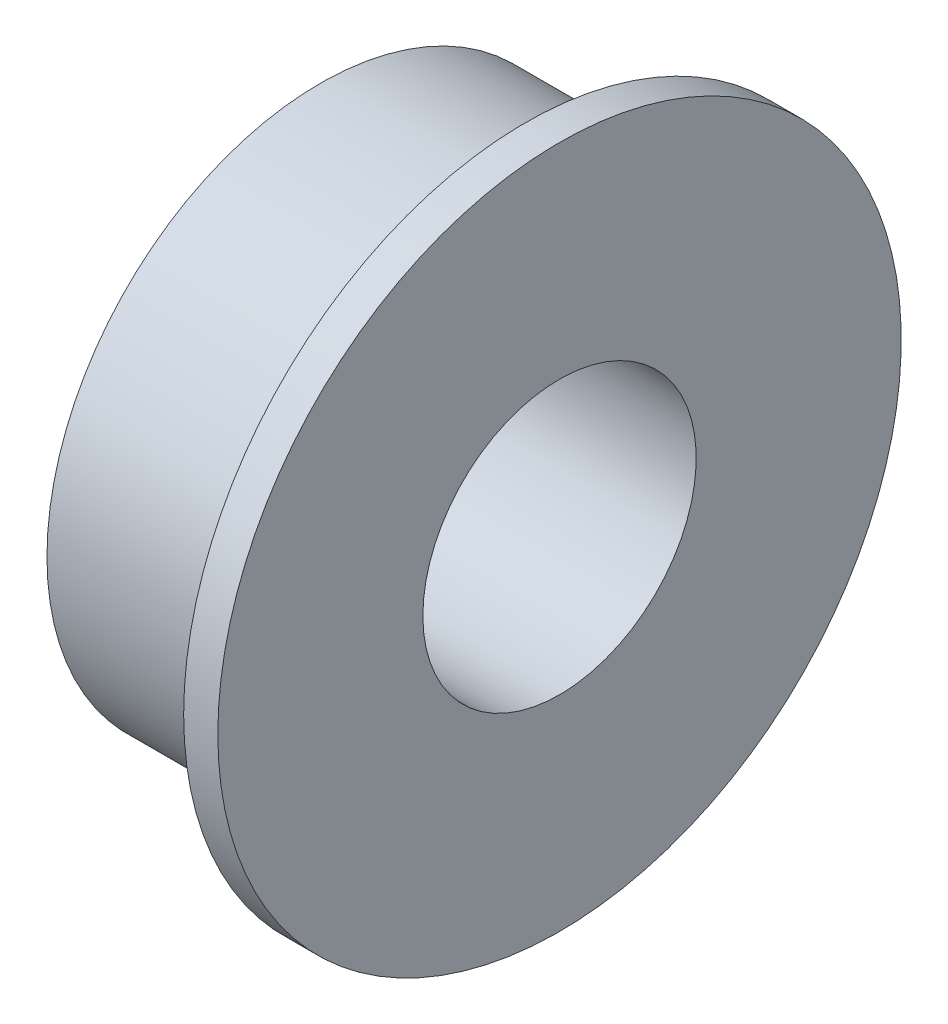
from build123d import *


with BuildPart() as part:
    # Esquisse2 → R_volution1 (revolve)
    with BuildSketch(Plane(origin=(0, 0, 0), x_dir=(-1, 0, 0), z_dir=(0, 1, 0))):
        Polygon((-20, 2), (-23.5, 2), (-23.5, 5), (-23, 5), (-23, 4), (-20, 4), align=None)
    revolve(axis=Axis((0, 0, 0), (1, 0, 0)))


solid = part.part
